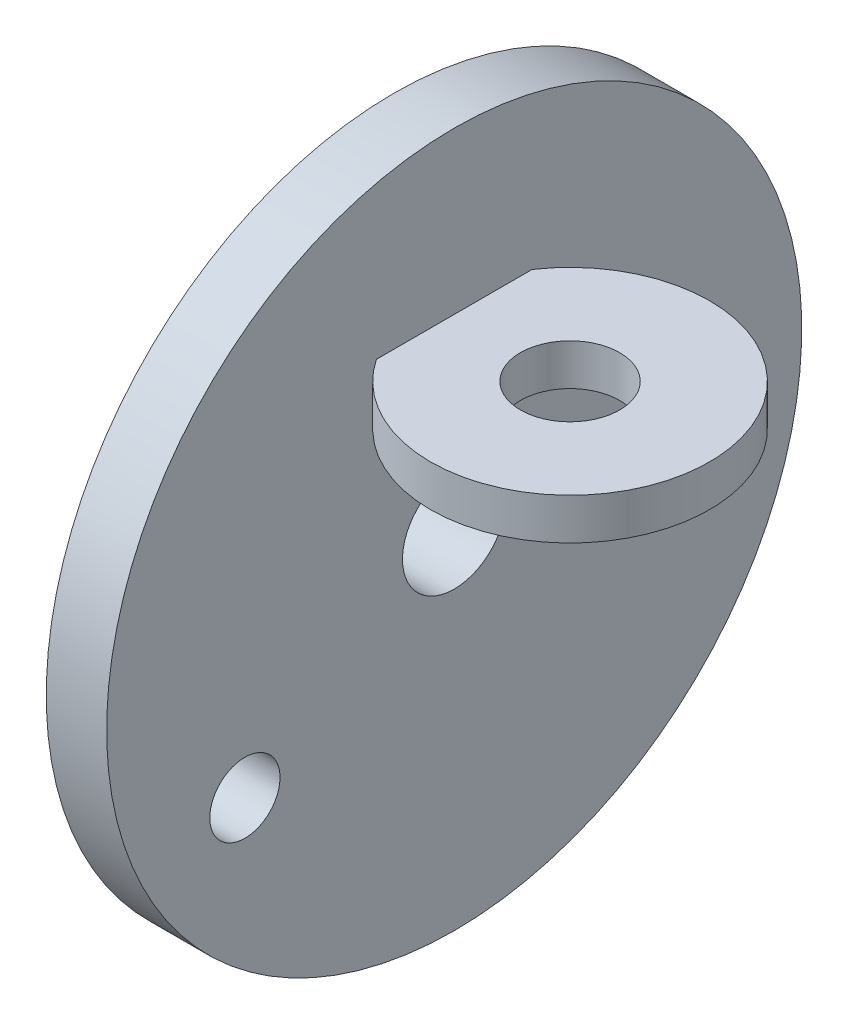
ISO-10303-21;
HEADER;
FILE_DESCRIPTION(('STEP AP214'),'2;1');
FILE_NAME('part.step','',(''),(''),'','','');
FILE_SCHEMA(('AUTOMOTIVE_DESIGN { 1 0 10303 214 1 1 1 1 }'));
ENDSEC;
DATA;
#1=APPLICATION_CONTEXT('core data for automotive mechanical design processes');
#2=APPLICATION_PROTOCOL_DEFINITION('international standard','automotive_design',2000,#1);
#3=PRODUCT_CONTEXT('',#1,'mechanical');
#4=PRODUCT('Part','Part','',(#3));
#5=PRODUCT_RELATED_PRODUCT_CATEGORY('part','',(#4));
#6=PRODUCT_DEFINITION_FORMATION('','',#4);
#7=PRODUCT_DEFINITION_CONTEXT('part definition',#1,'design');
#8=PRODUCT_DEFINITION('design','',#6,#7);
#9=PRODUCT_DEFINITION_SHAPE('','',#8);
#10=(LENGTH_UNIT() NAMED_UNIT(*) SI_UNIT(.MILLI.,.METRE.));
#11=(NAMED_UNIT(*) PLANE_ANGLE_UNIT() SI_UNIT($,.RADIAN.));
#12=(NAMED_UNIT(*) SI_UNIT($,.STERADIAN.) SOLID_ANGLE_UNIT());
#13=UNCERTAINTY_MEASURE_WITH_UNIT(LENGTH_MEASURE(1.E-05),#10,'distance_accuracy_value','');
#14=(GEOMETRIC_REPRESENTATION_CONTEXT(3) GLOBAL_UNCERTAINTY_ASSIGNED_CONTEXT((#13)) GLOBAL_UNIT_ASSIGNED_CONTEXT((#10,
#11,#12)) REPRESENTATION_CONTEXT('',''));
#15=CARTESIAN_POINT('',(0.,0.,0.));
#16=DIRECTION('',(0.,0.,1.));
#17=DIRECTION('',(1.,0.,0.));
#18=AXIS2_PLACEMENT_3D('',#15,#16,#17);
#19=CARTESIAN_POINT('',(-25.51162109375,168.,0.));
#20=DIRECTION('',(-1.,0.,0.));
#21=DIRECTION('',(0.,-1.,0.));
#22=AXIS2_PLACEMENT_3D('',#19,#20,#21);
#23=PLANE('',#22);
#24=CARTESIAN_POINT('',(-25.5116210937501,-61.726405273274,101.162719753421));
#25=DIRECTION('',(1.,0.,0.));
#26=DIRECTION('',(0.,1.,0.));
#27=AXIS2_PLACEMENT_3D('',#24,#25,#26);
#28=CIRCLE('',#27,16.9738954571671);
#29=CARTESIAN_POINT('',(-25.5116210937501,-44.7525098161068,101.162719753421));
#30=VERTEX_POINT('',#29);
#31=EDGE_CURVE('E421',#30,#30,#28,.T.);
#32=ORIENTED_EDGE('',*,*,#31,.F.);
#33=EDGE_LOOP('',(#32));
#34=FACE_BOUND('',#33,.T.);
#35=DIRECTION('',(0.,1.,0.));
#36=VECTOR('',#35,1.);
#37=CARTESIAN_POINT('',(-25.51162109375,84.9511922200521,37.6221364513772));
#38=LINE('',#37,#36);
#39=CARTESIAN_POINT('',(-25.51162109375,70.,37.6221364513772));
#40=VERTEX_POINT('',#39);
#41=CARTESIAN_POINT('',(-25.51162109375,90.0014925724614,37.6221364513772));
#42=VERTEX_POINT('',#41);
#43=EDGE_CURVE('E358',#40,#42,#38,.T.);
#44=ORIENTED_EDGE('',*,*,#43,.T.);
#45=DIRECTION('',(0.,0.,-1.));
#46=VECTOR('',#45,1.);
#47=CARTESIAN_POINT('',(-25.51162109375,90.0014925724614,0.));
#48=LINE('',#47,#46);
#49=CARTESIAN_POINT('',(-25.51162109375,90.0014925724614,-37.6221364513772));
#50=VERTEX_POINT('',#49);
#51=EDGE_CURVE('E11',#42,#50,#48,.T.);
#52=ORIENTED_EDGE('',*,*,#51,.T.);
#53=DIRECTION('',(0.,1.,0.));
#54=VECTOR('',#53,1.);
#55=CARTESIAN_POINT('',(-25.51162109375,84.9511922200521,-37.6221364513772));
#56=LINE('',#55,#54);
#57=CARTESIAN_POINT('',(-25.51162109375,70.,-37.6221364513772));
#58=VERTEX_POINT('',#57);
#59=EDGE_CURVE('E371',#50,#58,#56,.F.);
#60=ORIENTED_EDGE('',*,*,#59,.T.);
#61=DIRECTION('',(0.,0.,1.));
#62=VECTOR('',#61,1.);
#63=CARTESIAN_POINT('',(-25.51162109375,70.,0.));
#64=LINE('',#63,#62);
#65=EDGE_CURVE('E378',#58,#40,#64,.T.);
#66=ORIENTED_EDGE('',*,*,#65,.T.);
#67=EDGE_LOOP('',(#44,#52,#60,#66));
#68=FACE_BOUND('',#67,.T.);
#69=CARTESIAN_POINT('',(-25.5116210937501,0.,0.));
#70=DIRECTION('',(-1.,0.,0.));
#71=DIRECTION('',(0.,-1.,0.));
#72=AXIS2_PLACEMENT_3D('',#69,#70,#71);
#73=CIRCLE('',#72,168.);
#74=CARTESIAN_POINT('',(-25.5116210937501,-168.,0.));
#75=VERTEX_POINT('',#74);
#76=EDGE_CURVE('E412',#75,#75,#73,.T.);
#77=ORIENTED_EDGE('',*,*,#76,.F.);
#78=EDGE_LOOP('',(#77));
#79=FACE_BOUND('',#78,.T.);
#80=CARTESIAN_POINT('',(-25.51162109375,0.,0.));
#81=DIRECTION('',(-1.,0.,0.));
#82=DIRECTION('',(0.,-1.,0.));
#83=AXIS2_PLACEMENT_3D('',#80,#81,#82);
#84=CIRCLE('',#83,25.);
#85=CARTESIAN_POINT('',(-25.51162109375,-25.,0.));
#86=VERTEX_POINT('',#85);
#87=EDGE_CURVE('E382',#86,#86,#84,.T.);
#88=ORIENTED_EDGE('',*,*,#87,.T.);
#89=EDGE_LOOP('',(#88));
#90=FACE_BOUND('',#89,.T.);
#91=ADVANCED_FACE('F350',(#34,#68,#79,#90),#23,.F.);
#92=CARTESIAN_POINT('',(0.,0.,0.));
#93=DIRECTION('',(-1.,0.,0.));
#94=DIRECTION('',(0.,-1.,0.));
#95=AXIS2_PLACEMENT_3D('',#92,#93,#94);
#96=CYLINDRICAL_SURFACE('',#95,25.);
#97=ORIENTED_EDGE('',*,*,#87,.F.);
#98=EDGE_LOOP('',(#97));
#99=FACE_BOUND('',#98,.T.);
#100=CARTESIAN_POINT('',(-95.51044921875,0.,0.));
#101=DIRECTION('',(-1.,0.,0.));
#102=DIRECTION('',(0.,-1.,0.));
#103=AXIS2_PLACEMENT_3D('',#100,#101,#102);
#104=CIRCLE('',#103,25.);
#105=CARTESIAN_POINT('',(-95.51044921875,-25.,0.));
#106=VERTEX_POINT('',#105);
#107=EDGE_CURVE('E394',#106,#106,#104,.T.);
#108=ORIENTED_EDGE('',*,*,#107,.T.);
#109=EDGE_LOOP('',(#108));
#110=FACE_BOUND('',#109,.T.);
#111=ADVANCED_FACE('F443',(#99,#110),#96,.F.);
#112=CARTESIAN_POINT('',(-95.51044921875,25.,0.));
#113=DIRECTION('',(1.,0.,0.));
#114=DIRECTION('',(0.,1.,0.));
#115=AXIS2_PLACEMENT_3D('',#112,#113,#114);
#116=PLANE('',#115);
#117=ORIENTED_EDGE('',*,*,#107,.F.);
#118=EDGE_LOOP('',(#117));
#119=FACE_BOUND('',#118,.T.);
#120=CARTESIAN_POINT('',(-95.51044921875,0.,0.));
#121=DIRECTION('',(-1.,0.,0.));
#122=DIRECTION('',(0.,-1.,0.));
#123=AXIS2_PLACEMENT_3D('',#120,#121,#122);
#124=CIRCLE('',#123,50.7224609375);
#125=CARTESIAN_POINT('',(-95.51044921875,-50.7224609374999,0.));
#126=VERTEX_POINT('',#125);
#127=EDGE_CURVE('E397',#126,#126,#124,.T.);
#128=ORIENTED_EDGE('',*,*,#127,.T.);
#129=EDGE_LOOP('',(#128));
#130=FACE_BOUND('',#129,.T.);
#131=ADVANCED_FACE('F448',(#119,#130),#116,.F.);
#132=CARTESIAN_POINT('',(0.,0.,0.));
#133=DIRECTION('',(-1.,0.,0.));
#134=DIRECTION('',(0.,-1.,0.));
#135=AXIS2_PLACEMENT_3D('',#132,#133,#134);
#136=CYLINDRICAL_SURFACE('',#135,50.7224609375);
#137=ORIENTED_EDGE('',*,*,#127,.F.);
#138=EDGE_LOOP('',(#137));
#139=FACE_BOUND('',#138,.T.);
#140=CARTESIAN_POINT('',(-83.70341796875,0.,0.));
#141=DIRECTION('',(-1.,0.,0.));
#142=DIRECTION('',(0.,-1.,0.));
#143=AXIS2_PLACEMENT_3D('',#140,#141,#142);
#144=CIRCLE('',#143,50.7224609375);
#145=CARTESIAN_POINT('',(-83.70341796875,-50.7224609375,0.));
#146=VERTEX_POINT('',#145);
#147=EDGE_CURVE('E400',#146,#146,#144,.T.);
#148=ORIENTED_EDGE('',*,*,#147,.T.);
#149=EDGE_LOOP('',(#148));
#150=FACE_BOUND('',#149,.T.);
#151=ADVANCED_FACE('F453',(#139,#150),#136,.T.);
#152=CARTESIAN_POINT('',(-83.70341796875,50.7224609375,0.));
#153=DIRECTION('',(-1.,0.,0.));
#154=DIRECTION('',(0.,-1.,0.));
#155=AXIS2_PLACEMENT_3D('',#152,#153,#154);
#156=PLANE('',#155);
#157=ORIENTED_EDGE('',*,*,#147,.F.);
#158=EDGE_LOOP('',(#157));
#159=FACE_BOUND('',#158,.T.);
#160=CARTESIAN_POINT('',(-83.70341796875,0.,0.));
#161=DIRECTION('',(-1.,0.,0.));
#162=DIRECTION('',(0.,-1.,0.));
#163=AXIS2_PLACEMENT_3D('',#160,#161,#162);
#164=CIRCLE('',#163,36.);
#165=CARTESIAN_POINT('',(-83.70341796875,-36.,0.));
#166=VERTEX_POINT('',#165);
#167=EDGE_CURVE('E403',#166,#166,#164,.T.);
#168=ORIENTED_EDGE('',*,*,#167,.T.);
#169=EDGE_LOOP('',(#168));
#170=FACE_BOUND('',#169,.T.);
#171=ADVANCED_FACE('F461',(#159,#170),#156,.F.);
#172=CARTESIAN_POINT('',(0.,0.,0.));
#173=DIRECTION('',(-1.,0.,0.));
#174=DIRECTION('',(0.,-1.,0.));
#175=AXIS2_PLACEMENT_3D('',#172,#173,#174);
#176=CYLINDRICAL_SURFACE('',#175,36.);
#177=ORIENTED_EDGE('',*,*,#167,.F.);
#178=EDGE_LOOP('',(#177));
#179=FACE_BOUND('',#178,.T.);
#180=CARTESIAN_POINT('',(-54.70341796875,0.,0.));
#181=DIRECTION('',(-1.,0.,0.));
#182=DIRECTION('',(0.,-1.,0.));
#183=AXIS2_PLACEMENT_3D('',#180,#181,#182);
#184=CIRCLE('',#183,36.);
#185=CARTESIAN_POINT('',(-54.70341796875,-36.,0.));
#186=VERTEX_POINT('',#185);
#187=EDGE_CURVE('E406',#186,#186,#184,.T.);
#188=ORIENTED_EDGE('',*,*,#187,.T.);
#189=EDGE_LOOP('',(#188));
#190=FACE_BOUND('',#189,.T.);
#191=ADVANCED_FACE('F465',(#179,#190),#176,.T.);
#192=CARTESIAN_POINT('',(-54.70341796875,36.,0.));
#193=DIRECTION('',(1.,0.,0.));
#194=DIRECTION('',(0.,1.,0.));
#195=AXIS2_PLACEMENT_3D('',#192,#193,#194);
#196=PLANE('',#195);
#197=CARTESIAN_POINT('',(-54.7034179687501,-61.726405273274,101.162719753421));
#198=DIRECTION('',(1.,0.,0.));
#199=DIRECTION('',(0.,1.,0.));
#200=AXIS2_PLACEMENT_3D('',#197,#198,#199);
#201=CIRCLE('',#200,16.9738954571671);
#202=CARTESIAN_POINT('',(-54.7034179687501,-44.7525098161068,101.162719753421));
#203=VERTEX_POINT('',#202);
#204=EDGE_CURVE('E353',#203,#203,#201,.T.);
#205=ORIENTED_EDGE('',*,*,#204,.T.);
#206=EDGE_LOOP('',(#205));
#207=FACE_BOUND('',#206,.T.);
#208=ORIENTED_EDGE('',*,*,#187,.F.);
#209=EDGE_LOOP('',(#208));
#210=FACE_BOUND('',#209,.T.);
#211=CARTESIAN_POINT('',(-54.70341796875,0.,0.));
#212=DIRECTION('',(-1.,0.,0.));
#213=DIRECTION('',(0.,-1.,0.));
#214=AXIS2_PLACEMENT_3D('',#211,#212,#213);
#215=CIRCLE('',#214,168.);
#216=CARTESIAN_POINT('',(-54.7034179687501,-168.,0.));
#217=VERTEX_POINT('',#216);
#218=EDGE_CURVE('E409',#217,#217,#215,.T.);
#219=ORIENTED_EDGE('',*,*,#218,.T.);
#220=EDGE_LOOP('',(#219));
#221=FACE_BOUND('',#220,.T.);
#222=ADVANCED_FACE('F428',(#207,#210,#221),#196,.F.);
#223=CARTESIAN_POINT('',(0.,0.,0.));
#224=DIRECTION('',(-1.,0.,0.));
#225=DIRECTION('',(0.,-1.,0.));
#226=AXIS2_PLACEMENT_3D('',#223,#224,#225);
#227=CYLINDRICAL_SURFACE('',#226,168.);
#228=ORIENTED_EDGE('',*,*,#218,.F.);
#229=EDGE_LOOP('',(#228));
#230=FACE_BOUND('',#229,.T.);
#231=ORIENTED_EDGE('',*,*,#76,.T.);
#232=EDGE_LOOP('',(#231));
#233=FACE_BOUND('',#232,.T.);
#234=ADVANCED_FACE('F471',(#230,#233),#227,.T.);
#235=CARTESIAN_POINT('',(6.48837890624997,90.0014925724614,0.));
#236=DIRECTION('',(0.,1.,0.));
#237=DIRECTION('',(-1.,0.,0.));
#238=AXIS2_PLACEMENT_3D('',#235,#236,#237);
#239=PLANE('',#238);
#240=CARTESIAN_POINT('',(30.48837890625,90.0014925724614,0.));
#241=DIRECTION('',(0.,1.,0.));
#242=DIRECTION('',(-1.,0.,0.));
#243=AXIS2_PLACEMENT_3D('',#240,#241,#242);
#244=CIRCLE('',#243,24.);
#245=CARTESIAN_POINT('',(6.48837890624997,90.0014925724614,0.));
#246=VERTEX_POINT('',#245);
#247=EDGE_CURVE('E415',#246,#246,#244,.T.);
#248=ORIENTED_EDGE('',*,*,#247,.F.);
#249=EDGE_LOOP('',(#248));
#250=FACE_BOUND('',#249,.T.);
#251=ORIENTED_EDGE('',*,*,#51,.F.);
#252=CARTESIAN_POINT('',(30.48837890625,90.0014925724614,0.));
#253=DIRECTION('',(0.,1.,0.));
#254=DIRECTION('',(-1.,0.,0.));
#255=AXIS2_PLACEMENT_3D('',#252,#253,#254);
#256=CIRCLE('',#255,67.4642509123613);
#257=EDGE_CURVE('E385',#42,#50,#256,.T.);
#258=ORIENTED_EDGE('',*,*,#257,.T.);
#259=EDGE_LOOP('',(#251,#258));
#260=FACE_BOUND('',#259,.T.);
#261=ADVANCED_FACE('F473',(#250,#260),#239,.T.);
#262=CARTESIAN_POINT('',(30.48837890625,84.9511922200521,0.));
#263=DIRECTION('',(0.,1.,0.));
#264=DIRECTION('',(-1.,0.,0.));
#265=AXIS2_PLACEMENT_3D('',#262,#263,#264);
#266=CYLINDRICAL_SURFACE('',#265,67.4642509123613);
#267=ORIENTED_EDGE('',*,*,#43,.F.);
#268=CARTESIAN_POINT('',(30.48837890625,70.,0.));
#269=DIRECTION('',(0.,1.,0.));
#270=DIRECTION('',(-1.,0.,0.));
#271=AXIS2_PLACEMENT_3D('',#268,#269,#270);
#272=CIRCLE('',#271,67.4642509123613);
#273=EDGE_CURVE('E364',#40,#58,#272,.T.);
#274=ORIENTED_EDGE('',*,*,#273,.T.);
#275=ORIENTED_EDGE('',*,*,#59,.F.);
#276=ORIENTED_EDGE('',*,*,#257,.F.);
#277=EDGE_LOOP('',(#267,#274,#275,#276));
#278=FACE_BOUND('',#277,.T.);
#279=ADVANCED_FACE('F384',(#278),#266,.T.);
#280=CARTESIAN_POINT('',(6.48837890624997,70.,0.));
#281=DIRECTION('',(0.,-1.,0.));
#282=DIRECTION('',(1.,0.,0.));
#283=AXIS2_PLACEMENT_3D('',#280,#281,#282);
#284=PLANE('',#283);
#285=CARTESIAN_POINT('',(30.48837890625,70.,0.));
#286=DIRECTION('',(0.,1.,0.));
#287=DIRECTION('',(-1.,0.,0.));
#288=AXIS2_PLACEMENT_3D('',#285,#286,#287);
#289=CIRCLE('',#288,24.);
#290=CARTESIAN_POINT('',(6.48837890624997,70.,0.));
#291=VERTEX_POINT('',#290);
#292=EDGE_CURVE('E386',#291,#291,#289,.T.);
#293=ORIENTED_EDGE('',*,*,#292,.T.);
#294=EDGE_LOOP('',(#293));
#295=FACE_BOUND('',#294,.T.);
#296=ORIENTED_EDGE('',*,*,#65,.F.);
#297=ORIENTED_EDGE('',*,*,#273,.F.);
#298=EDGE_LOOP('',(#296,#297));
#299=FACE_BOUND('',#298,.T.);
#300=ADVANCED_FACE('F379',(#295,#299),#284,.T.);
#301=CARTESIAN_POINT('',(30.48837890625,84.9511922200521,0.));
#302=DIRECTION('',(0.,1.,0.));
#303=DIRECTION('',(-1.,0.,0.));
#304=AXIS2_PLACEMENT_3D('',#301,#302,#303);
#305=CYLINDRICAL_SURFACE('',#304,24.);
#306=ORIENTED_EDGE('',*,*,#247,.T.);
#307=EDGE_LOOP('',(#306));
#308=FACE_BOUND('',#307,.T.);
#309=ORIENTED_EDGE('',*,*,#292,.F.);
#310=EDGE_LOOP('',(#309));
#311=FACE_BOUND('',#310,.T.);
#312=ADVANCED_FACE('F433',(#308,#311),#305,.F.);
#313=CARTESIAN_POINT('',(-95.5104492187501,-61.7264052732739,101.162719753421));
#314=DIRECTION('',(1.,0.,0.));
#315=DIRECTION('',(0.,1.,0.));
#316=AXIS2_PLACEMENT_3D('',#313,#314,#315);
#317=CYLINDRICAL_SURFACE('',#316,16.9738954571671);
#318=CARTESIAN_POINT('',(-25.5116210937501,-44.7525098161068,101.162719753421));
#319=CARTESIAN_POINT('',(-25.815702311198,-44.7525098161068,101.162719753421));
#320=CARTESIAN_POINT('',(-26.1197835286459,-44.7525098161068,101.162719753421));
#321=CARTESIAN_POINT('',(-26.7279459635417,-44.7525098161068,101.162719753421));
#322=CARTESIAN_POINT('',(-27.0320271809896,-44.7525098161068,101.162719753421));
#323=CARTESIAN_POINT('',(-27.6401896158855,-44.7525098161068,101.162719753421));
#324=CARTESIAN_POINT('',(-27.9442708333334,-44.7525098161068,101.162719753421));
#325=CARTESIAN_POINT('',(-28.5524332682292,-44.7525098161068,101.162719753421));
#326=CARTESIAN_POINT('',(-28.8565144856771,-44.7525098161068,101.162719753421));
#327=CARTESIAN_POINT('',(-29.464676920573,-44.7525098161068,101.162719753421));
#328=CARTESIAN_POINT('',(-29.7687581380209,-44.7525098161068,101.162719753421));
#329=CARTESIAN_POINT('',(-30.3769205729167,-44.7525098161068,101.162719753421));
#330=CARTESIAN_POINT('',(-30.6810017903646,-44.7525098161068,101.162719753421));
#331=CARTESIAN_POINT('',(-31.2891642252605,-44.7525098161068,101.162719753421));
#332=CARTESIAN_POINT('',(-31.5932454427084,-44.7525098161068,101.162719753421));
#333=CARTESIAN_POINT('',(-32.2014078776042,-44.7525098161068,101.162719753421));
#334=CARTESIAN_POINT('',(-32.5054890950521,-44.7525098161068,101.162719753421));
#335=CARTESIAN_POINT('',(-33.113651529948,-44.7525098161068,101.162719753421));
#336=CARTESIAN_POINT('',(-33.4177327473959,-44.7525098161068,101.162719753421));
#337=CARTESIAN_POINT('',(-34.0258951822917,-44.7525098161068,101.162719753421));
#338=CARTESIAN_POINT('',(-34.3299763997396,-44.7525098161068,101.162719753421));
#339=CARTESIAN_POINT('',(-34.9381388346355,-44.7525098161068,101.162719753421));
#340=CARTESIAN_POINT('',(-35.2422200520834,-44.7525098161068,101.162719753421));
#341=CARTESIAN_POINT('',(-35.8503824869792,-44.7525098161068,101.162719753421));
#342=CARTESIAN_POINT('',(-36.1544637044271,-44.7525098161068,101.162719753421));
#343=CARTESIAN_POINT('',(-36.762626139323,-44.7525098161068,101.162719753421));
#344=CARTESIAN_POINT('',(-37.0667073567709,-44.7525098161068,101.162719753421));
#345=CARTESIAN_POINT('',(-37.6748697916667,-44.7525098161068,101.162719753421));
#346=CARTESIAN_POINT('',(-37.9789510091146,-44.7525098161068,101.162719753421));
#347=CARTESIAN_POINT('',(-38.5871134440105,-44.7525098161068,101.162719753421));
#348=CARTESIAN_POINT('',(-38.8911946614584,-44.7525098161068,101.162719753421));
#349=CARTESIAN_POINT('',(-39.4993570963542,-44.7525098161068,101.162719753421));
#350=CARTESIAN_POINT('',(-39.8034383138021,-44.7525098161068,101.162719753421));
#351=CARTESIAN_POINT('',(-40.411600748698,-44.7525098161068,101.162719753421));
#352=CARTESIAN_POINT('',(-40.7156819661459,-44.7525098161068,101.162719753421));
#353=CARTESIAN_POINT('',(-41.3238444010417,-44.7525098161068,101.162719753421));
#354=CARTESIAN_POINT('',(-41.6279256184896,-44.7525098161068,101.162719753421));
#355=CARTESIAN_POINT('',(-42.2360880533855,-44.7525098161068,101.162719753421));
#356=CARTESIAN_POINT('',(-42.5401692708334,-44.7525098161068,101.162719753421));
#357=CARTESIAN_POINT('',(-43.1483317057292,-44.7525098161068,101.162719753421));
#358=CARTESIAN_POINT('',(-43.4524129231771,-44.7525098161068,101.162719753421));
#359=CARTESIAN_POINT('',(-44.060575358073,-44.7525098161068,101.162719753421));
#360=CARTESIAN_POINT('',(-44.3646565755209,-44.7525098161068,101.162719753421));
#361=CARTESIAN_POINT('',(-44.9728190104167,-44.7525098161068,101.162719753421));
#362=CARTESIAN_POINT('',(-45.2769002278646,-44.7525098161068,101.162719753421));
#363=CARTESIAN_POINT('',(-45.8850626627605,-44.7525098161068,101.162719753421));
#364=CARTESIAN_POINT('',(-46.1891438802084,-44.7525098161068,101.162719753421));
#365=CARTESIAN_POINT('',(-46.7973063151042,-44.7525098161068,101.162719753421));
#366=CARTESIAN_POINT('',(-47.1013875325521,-44.7525098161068,101.162719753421));
#367=CARTESIAN_POINT('',(-47.709549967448,-44.7525098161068,101.162719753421));
#368=CARTESIAN_POINT('',(-48.0136311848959,-44.7525098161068,101.162719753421));
#369=CARTESIAN_POINT('',(-48.6217936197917,-44.7525098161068,101.162719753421));
#370=CARTESIAN_POINT('',(-48.9258748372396,-44.7525098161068,101.162719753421));
#371=CARTESIAN_POINT('',(-49.5340372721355,-44.7525098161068,101.162719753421));
#372=CARTESIAN_POINT('',(-49.8381184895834,-44.7525098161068,101.162719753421));
#373=CARTESIAN_POINT('',(-50.4462809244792,-44.7525098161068,101.162719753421));
#374=CARTESIAN_POINT('',(-50.7503621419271,-44.7525098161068,101.162719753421));
#375=CARTESIAN_POINT('',(-51.358524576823,-44.7525098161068,101.162719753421));
#376=CARTESIAN_POINT('',(-51.6626057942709,-44.7525098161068,101.162719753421));
#377=CARTESIAN_POINT('',(-52.2707682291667,-44.7525098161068,101.162719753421));
#378=CARTESIAN_POINT('',(-52.5748494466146,-44.7525098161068,101.162719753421));
#379=CARTESIAN_POINT('',(-53.1830118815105,-44.7525098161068,101.162719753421));
#380=CARTESIAN_POINT('',(-53.4870930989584,-44.7525098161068,101.162719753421));
#381=CARTESIAN_POINT('',(-54.0952555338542,-44.7525098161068,101.162719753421));
#382=CARTESIAN_POINT('',(-54.3993367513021,-44.7525098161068,101.162719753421));
#383=CARTESIAN_POINT('',(-54.7034179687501,-44.7525098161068,101.162719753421));
#384=B_SPLINE_CURVE_WITH_KNOTS('',3,(#318,#319,#320,#321,#322,#323,#324,#325,#326,#327,#328,
#329,#330,#331,#332,#333,#334,#335,#336,#337,#338,#339,#340,#341,#342,#343,#344,#345,#346,#347,
#348,#349,#350,#351,#352,#353,#354,#355,#356,#357,#358,#359,#360,#361,#362,#363,#364,#365,#366,
#367,#368,#369,#370,#371,#372,#373,#374,#375,#376,#377,#378,#379,#380,#381,#382,#383),
.UNSPECIFIED.,.F.,.F.,(4,2,2,2,2,2,2,2,2,2,2,2,2,2,2,2,2,2,2,2,2,2,2,2,2,2,2,2,2,2,2,2,4),(0.,
0.912243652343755,1.8244873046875,2.73673095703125,3.64897460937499,4.56121826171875,
5.47346191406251,6.38570556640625,7.29794921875,8.21019287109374,9.12243652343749,
10.0346801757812,10.946923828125,11.8591674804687,12.7714111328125,13.6836547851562,
14.5958984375,15.5081420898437,16.4203857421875,17.3326293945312,18.244873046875,
19.1571166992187,20.0693603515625,20.9816040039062,21.89384765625,22.8060913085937,
23.7183349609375,24.6305786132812,25.542822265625,26.4550659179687,27.3673095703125,
28.2795532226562,29.191796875),.UNSPECIFIED.);
#385=EDGE_CURVE('BSEAM431',#30,#203,#384,.T.);
#386=ORIENTED_EDGE('',*,*,#31,.T.);
#387=ORIENTED_EDGE('',*,*,#204,.F.);
#388=ORIENTED_EDGE('',*,*,#385,.T.);
#389=ORIENTED_EDGE('',*,*,#385,.F.);
#390=EDGE_LOOP('',(#386,#388,#387,#389));
#391=FACE_BOUND('',#390,.T.);
#392=ADVANCED_FACE('F431',(#391),#317,.F.);
#393=CLOSED_SHELL('',(#91,#111,#131,#151,#171,#191,#222,#234,#261,#279,#300,#312,#392));
#394=MANIFOLD_SOLID_BREP('B2',#393);
#395=ADVANCED_BREP_SHAPE_REPRESENTATION('',(#18,#394),#14);
#396=SHAPE_DEFINITION_REPRESENTATION(#9,#395);
ENDSEC;
END-ISO-10303-21;
